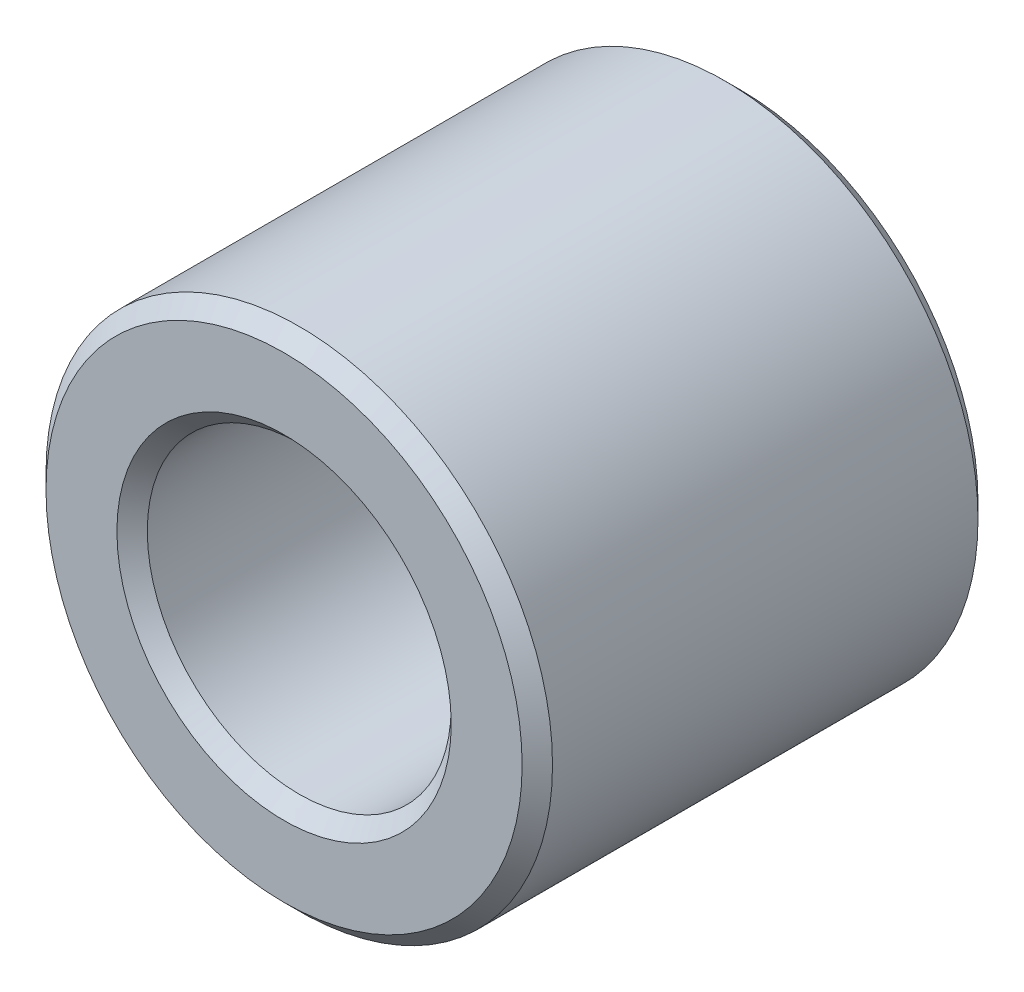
from build123d import *

# Parameters (mm, degrees)
SKETCH1_R           = 50
SKETCH1_R_2         = 30
BOSS_EXTRUDE1_DEPTH = 45
CHAMFER1_SIZE       = 3


with BuildPart() as part:
    # Sketch1 → Boss-Extrude1 (new, symmetric)
    with BuildSketch(Plane.XY):
        with Locations(Location((0, 0, 0), (0, 0, 180))):
            Circle(SKETCH1_R)
        with Locations(Location((0, 0, 0), (0, 0, 180))):
            Circle(SKETCH1_R_2, mode=Mode.SUBTRACT)
    extrude(amount=BOSS_EXTRUDE1_DEPTH, both=True)

    # Chamfer1
    chamfer1_edges = [part.edges().sort_by_distance(p)[0] for p in [
        (50, 0, -45),
        (50, 0, 45),
        (30, 0, -45),
        (30, 0, 45),
    ]]
    chamfer(chamfer1_edges, length=CHAMFER1_SIZE)


solid = part.part
